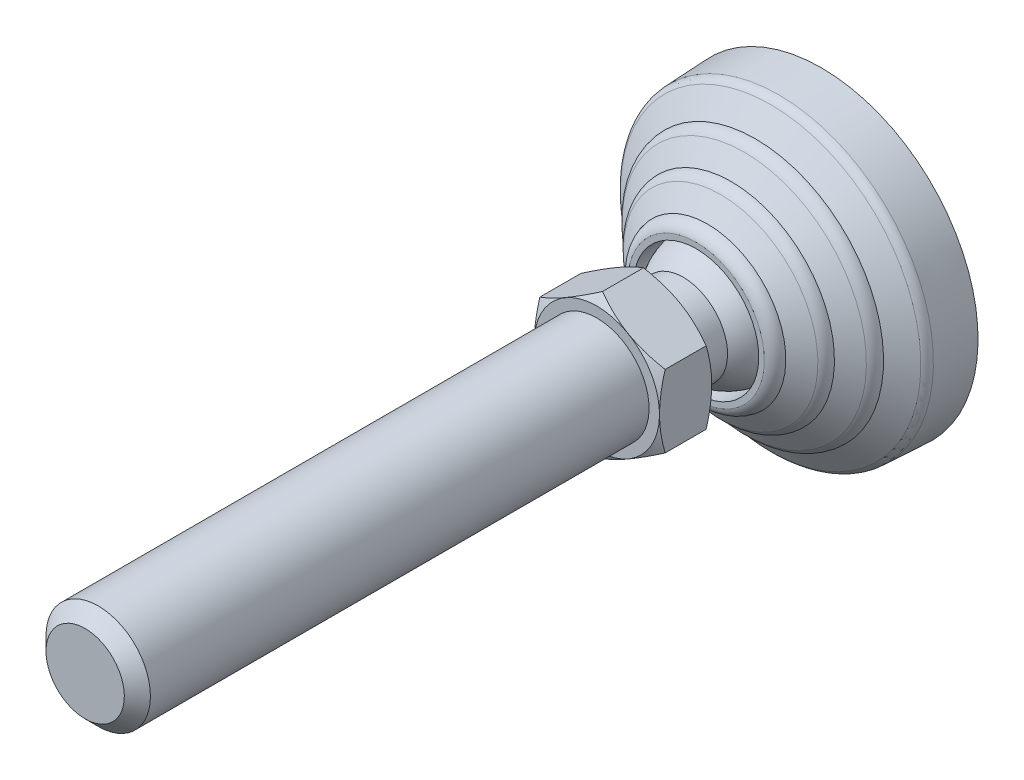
ISO-10303-21;
HEADER;
FILE_DESCRIPTION(('STEP AP214'),'2;1');
FILE_NAME('part.step','',(''),(''),'','','');
FILE_SCHEMA(('AUTOMOTIVE_DESIGN { 1 0 10303 214 1 1 1 1 }'));
ENDSEC;
DATA;
#1=APPLICATION_CONTEXT('core data for automotive mechanical design processes');
#2=APPLICATION_PROTOCOL_DEFINITION('international standard','automotive_design',2000,#1);
#3=PRODUCT_CONTEXT('',#1,'mechanical');
#4=PRODUCT('Part','Part','',(#3));
#5=PRODUCT_RELATED_PRODUCT_CATEGORY('part','',(#4));
#6=PRODUCT_DEFINITION_FORMATION('','',#4);
#7=PRODUCT_DEFINITION_CONTEXT('part definition',#1,'design');
#8=PRODUCT_DEFINITION('design','',#6,#7);
#9=PRODUCT_DEFINITION_SHAPE('','',#8);
#10=(LENGTH_UNIT() NAMED_UNIT(*) SI_UNIT(.MILLI.,.METRE.));
#11=(NAMED_UNIT(*) PLANE_ANGLE_UNIT() SI_UNIT($,.RADIAN.));
#12=(NAMED_UNIT(*) SI_UNIT($,.STERADIAN.) SOLID_ANGLE_UNIT());
#13=UNCERTAINTY_MEASURE_WITH_UNIT(LENGTH_MEASURE(1.E-05),#10,'distance_accuracy_value','');
#14=(GEOMETRIC_REPRESENTATION_CONTEXT(3) GLOBAL_UNCERTAINTY_ASSIGNED_CONTEXT((#13)) GLOBAL_UNIT_ASSIGNED_CONTEXT((#10,
#11,#12)) REPRESENTATION_CONTEXT('',''));
#15=CARTESIAN_POINT('',(0.,0.,0.));
#16=DIRECTION('',(0.,0.,1.));
#17=DIRECTION('',(1.,0.,0.));
#18=AXIS2_PLACEMENT_3D('',#15,#16,#17);
#19=CARTESIAN_POINT('',(0.,0.,110.4665));
#20=DIRECTION('',(0.,0.,-1.));
#21=DIRECTION('',(0.,1.,0.));
#22=AXIS2_PLACEMENT_3D('',#19,#20,#21);
#23=CYLINDRICAL_SURFACE('',#22,10.);
#24=CARTESIAN_POINT('',(0.,0.,138.5));
#25=DIRECTION('',(0.,0.,1.));
#26=DIRECTION('',(0.,-1.,0.));
#27=AXIS2_PLACEMENT_3D('',#24,#25,#26);
#28=CIRCLE('',#27,10.);
#29=CARTESIAN_POINT('',(0.,-10.,138.5));
#30=VERTEX_POINT('',#29);
#31=EDGE_CURVE('E9',#30,#30,#28,.F.);
#32=ORIENTED_EDGE('',*,*,#31,.T.);
#33=EDGE_LOOP('',(#32));
#34=FACE_BOUND('',#33,.T.);
#35=CARTESIAN_POINT('',(0.,0.,43.));
#36=DIRECTION('',(0.,0.,-1.));
#37=DIRECTION('',(0.,1.,0.));
#38=AXIS2_PLACEMENT_3D('',#35,#36,#37);
#39=CIRCLE('',#38,10.);
#40=CARTESIAN_POINT('',(0.,10.,43.));
#41=VERTEX_POINT('',#40);
#42=EDGE_CURVE('E124',#41,#41,#39,.F.);
#43=ORIENTED_EDGE('',*,*,#42,.T.);
#44=EDGE_LOOP('',(#43));
#45=FACE_BOUND('',#44,.T.);
#46=ADVANCED_FACE('F14',(#34,#45),#23,.T.);
#47=CARTESIAN_POINT('',(10.995,0.,43.));
#48=DIRECTION('',(0.,0.,1.));
#49=DIRECTION('',(0.,-1.,0.));
#50=AXIS2_PLACEMENT_3D('',#47,#48,#49);
#51=PLANE('',#50);
#52=CARTESIAN_POINT('',(0.,0.,43.));
#53=DIRECTION('',(0.,0.,-1.));
#54=DIRECTION('',(0.,1.,0.));
#55=AXIS2_PLACEMENT_3D('',#52,#53,#54);
#56=CIRCLE('',#55,11.99);
#57=CARTESIAN_POINT('',(0.,11.99,43.));
#58=VERTEX_POINT('',#57);
#59=EDGE_CURVE('E132',#58,#58,#56,.F.);
#60=ORIENTED_EDGE('',*,*,#59,.T.);
#61=EDGE_LOOP('',(#60));
#62=FACE_BOUND('',#61,.T.);
#63=ORIENTED_EDGE('',*,*,#42,.F.);
#64=EDGE_LOOP('',(#63));
#65=FACE_BOUND('',#64,.T.);
#66=ADVANCED_FACE('F157',(#62,#65),#51,.T.);
#67=CARTESIAN_POINT('',(0.,0.,41.9159643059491));
#68=DIRECTION('',(0.,0.,-1.));
#69=DIRECTION('',(0.,1.,0.));
#70=AXIS2_PLACEMENT_3D('',#67,#68,#69);
#71=CONICAL_SURFACE('',#70,13.8676048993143,1.0471975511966);
#72=ORIENTED_EDGE('',*,*,#59,.F.);
#73=EDGE_LOOP('',(#72));
#74=FACE_BOUND('',#73,.T.);
#75=CARTESIAN_POINT('',(-2.88482840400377E-08,-13.8564064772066,41.9224297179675));
#76=CARTESIAN_POINT('',(0.263784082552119,-13.7041106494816,42.0103407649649));
#77=CARTESIAN_POINT('',(0.528551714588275,-13.5512469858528,42.0942615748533));
#78=CARTESIAN_POINT('',(1.06021019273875,-13.2442938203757,42.2530155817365));
#79=CARTESIAN_POINT('',(1.32710170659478,-13.0902039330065,42.3278457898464));
#80=CARTESIAN_POINT('',(2.13207647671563,-12.6254515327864,42.537252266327));
#81=CARTESIAN_POINT('',(2.67333741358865,-12.3129543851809,42.6563603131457));
#82=CARTESIAN_POINT('',(3.48330954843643,-11.8453167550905,42.796023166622));
#83=CARTESIAN_POINT('',(3.74960108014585,-11.6915732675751,42.8358073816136));
#84=CARTESIAN_POINT('',(4.28341699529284,-11.3833745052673,42.9025217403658));
#85=CARTESIAN_POINT('',(4.55094140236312,-11.2289192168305,42.9294516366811));
#86=CARTESIAN_POINT('',(5.08643614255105,-10.9197511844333,42.9697675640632));
#87=CARTESIAN_POINT('',(5.35440556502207,-10.7650389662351,42.9831696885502));
#88=CARTESIAN_POINT('',(5.8905925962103,-10.4554712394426,42.996144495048));
#89=CARTESIAN_POINT('',(6.15881019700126,-10.3006157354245,42.9957176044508));
#90=CARTESIAN_POINT('',(6.66023029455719,-10.0111207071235,42.9820002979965));
#91=CARTESIAN_POINT('',(6.8934685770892,-9.87646052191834,42.97038309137));
#92=CARTESIAN_POINT('',(7.35940867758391,-9.60744987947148,42.9369099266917));
#93=CARTESIAN_POINT('',(7.59211045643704,-9.47309944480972,42.9150532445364));
#94=CARTESIAN_POINT('',(8.05685109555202,-9.20478131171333,42.8614821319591));
#95=CARTESIAN_POINT('',(8.28888924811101,-9.07081402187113,42.8297595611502));
#96=CARTESIAN_POINT('',(8.75187776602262,-8.80350747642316,42.7570131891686));
#97=CARTESIAN_POINT('',(8.9828280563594,-8.6701682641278,42.7159887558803));
#98=CARTESIAN_POINT('',(9.68388987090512,-8.26541003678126,42.5779256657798));
#99=CARTESIAN_POINT('',(10.1519713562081,-7.99516306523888,42.4671213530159));
#100=CARTESIAN_POINT('',(11.081155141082,-7.45869855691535,42.2156417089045));
#101=CARTESIAN_POINT('',(11.5422693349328,-7.19247415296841,42.075025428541));
#102=CARTESIAN_POINT('',(11.9999999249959,-6.92820327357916,41.922429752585));
#103=B_SPLINE_CURVE_WITH_KNOTS('',3,(#75,#76,#77,#78,#79,#80,#81,#82,#83,#84,#85,#86,#87,#88,
#89,#90,#91,#92,#93,#94,#95,#96,#97,#98,#99,#100,#101,#102),.UNSPECIFIED.,.F.,.F.,(4,2,2,2,2,2,
2,2,2,2,2,2,2,4),(0.,0.950996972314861,1.90230578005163,3.80897261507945,4.73890631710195,
5.66885791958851,6.59770188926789,7.52651715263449,8.33503482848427,9.14360968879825,
9.95285348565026,10.7621522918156,12.4163368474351,14.0672749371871),.UNSPECIFIED.);
#104=CARTESIAN_POINT('',(-1.44241383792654E-08,-13.8564064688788,41.9224297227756));
#105=VERTEX_POINT('',#104);
#106=CARTESIAN_POINT('',(12.,-6.92820324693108,41.9224297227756));
#107=VERTEX_POINT('',#106);
#108=EDGE_CURVE('E143',#105,#107,#103,.T.);
#109=ORIENTED_EDGE('',*,*,#108,.T.);
#110=CARTESIAN_POINT('',(12.,-6.92820326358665,41.9224297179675));
#111=CARTESIAN_POINT('',(12.,-6.64374493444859,42.0045333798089));
#112=CARTESIAN_POINT('',(12.,-6.35829458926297,42.0831531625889));
#113=CARTESIAN_POINT('',(12.,-5.78524260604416,42.2325348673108));
#114=CARTESIAN_POINT('',(12.,-5.49764024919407,42.3032940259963));
#115=CARTESIAN_POINT('',(12.,-4.63053083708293,42.5026195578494));
#116=CARTESIAN_POINT('',(12.,-4.04782834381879,42.6179071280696));
#117=CARTESIAN_POINT('',(12.,-3.17548925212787,42.7575170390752));
#118=CARTESIAN_POINT('',(12.,-2.88840964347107,42.7982045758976));
#119=CARTESIAN_POINT('',(12.,-2.31290718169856,42.8685767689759));
#120=CARTESIAN_POINT('',(12.,-2.02448443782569,42.8982623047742));
#121=CARTESIAN_POINT('',(12.,-1.44696804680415,42.9459902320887));
#122=CARTESIAN_POINT('',(12.,-1.15787537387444,42.9640443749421));
#123=CARTESIAN_POINT('',(12.,-0.579188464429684,42.9881624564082));
#124=CARTESIAN_POINT('',(12.,-0.289594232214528,42.994226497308));
#125=CARTESIAN_POINT('',(12.,0.289594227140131,42.9942264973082));
#126=CARTESIAN_POINT('',(12.,0.579188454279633,42.9881624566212));
#127=CARTESIAN_POINT('',(12.,1.15787535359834,42.9640443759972));
#128=CARTESIAN_POINT('',(12.,1.44696802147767,42.9459902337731));
#129=CARTESIAN_POINT('',(12.,2.02448440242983,42.8982623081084));
#130=CARTESIAN_POINT('',(12.,2.31290714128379,42.8685767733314));
#131=CARTESIAN_POINT('',(12.,2.88840959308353,42.798204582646));
#132=CARTESIAN_POINT('',(12.,3.17548919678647,42.7575170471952));
#133=CARTESIAN_POINT('',(12.,4.04782827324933,42.6179071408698));
#134=CARTESIAN_POINT('',(12.,4.63053075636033,42.5026195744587));
#135=CARTESIAN_POINT('',(12.,5.49764015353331,42.3032940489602));
#136=CARTESIAN_POINT('',(12.,5.78524250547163,42.2325348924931));
#137=CARTESIAN_POINT('',(12.,6.35829447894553,42.0831531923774));
#138=CARTESIAN_POINT('',(12.,6.64374481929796,42.004533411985));
#139=CARTESIAN_POINT('',(12.,6.92820314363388,41.9224297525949));
#140=B_SPLINE_CURVE_WITH_KNOTS('',3,(#110,#111,#112,#113,#114,#115,#116,#117,#118,#119,#120,
#121,#122,#123,#124,#125,#126,#127,#128,#129,#130,#131,#132,#133,#134,#135,#136,#137,#138,#139),
.UNSPECIFIED.,.F.,.F.,(4,2,2,2,2,2,2,2,2,2,2,2,2,2,4),(0.,0.888148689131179,1.77660860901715,
3.55698615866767,4.42666281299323,5.2962699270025,6.16499708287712,7.03371682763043,
7.90243655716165,8.7711636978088,9.64077079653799,10.5104474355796,12.2908249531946,
13.1792848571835,14.0674335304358),.UNSPECIFIED.);
#141=CARTESIAN_POINT('',(12.0000000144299,6.92820322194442,41.9224297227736));
#142=VERTEX_POINT('',#141);
#143=EDGE_CURVE('E135',#107,#142,#140,.T.);
#144=ORIENTED_EDGE('',*,*,#143,.T.);
#145=CARTESIAN_POINT('',(12.0000000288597,6.92820321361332,41.9224297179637));
#146=CARTESIAN_POINT('',(11.7362159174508,7.08049904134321,42.0103407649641));
#147=CARTESIAN_POINT('',(11.4714482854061,7.23336270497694,42.0942615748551));
#148=CARTESIAN_POINT('',(10.9397898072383,7.54031587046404,42.2530155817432));
#149=CARTESIAN_POINT('',(10.6728982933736,7.69440575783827,42.3278457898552));
#150=CARTESIAN_POINT('',(9.86792352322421,8.15915815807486,42.5372522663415));
#151=CARTESIAN_POINT('',(9.32666258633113,8.47165530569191,42.6563603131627));
#152=CARTESIAN_POINT('',(8.51669045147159,8.93929293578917,42.7960231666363));
#153=CARTESIAN_POINT('',(8.25039891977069,9.0930364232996,42.8358073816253));
#154=CARTESIAN_POINT('',(7.71658300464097,9.40123518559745,42.9025217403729));
#155=CARTESIAN_POINT('',(7.44905859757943,9.55569047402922,42.9294516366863));
#156=CARTESIAN_POINT('',(6.91356385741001,9.86485850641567,42.9697675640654));
#157=CARTESIAN_POINT('',(6.64559443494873,10.0195707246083,42.9831696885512));
#158=CARTESIAN_POINT('',(6.10940740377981,10.3291384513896,42.996144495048));
#159=CARTESIAN_POINT('',(5.84118980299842,10.4839939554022,42.9957176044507));
#160=CARTESIAN_POINT('',(5.33976970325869,10.773488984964,42.9820002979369));
#161=CARTESIAN_POINT('',(5.10653141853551,10.9081491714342,42.970383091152));
#162=CARTESIAN_POINT('',(4.64059131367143,11.1771598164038,42.9369099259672));
#163=CARTESIAN_POINT('',(4.4078895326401,11.3115102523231,42.9150532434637));
#164=CARTESIAN_POINT('',(3.94314888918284,11.5798283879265,42.8614821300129));
#165=CARTESIAN_POINT('',(3.71111073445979,11.7137956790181,42.8297595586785));
#166=CARTESIAN_POINT('',(3.24812221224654,11.9811022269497,42.7570131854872));
#167=CARTESIAN_POINT('',(3.01717191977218,12.1144414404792,42.7159887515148));
#168=CARTESIAN_POINT('',(2.31611009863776,12.5191996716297,42.5779256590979));
#169=CARTESIAN_POINT('',(1.84802860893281,12.7894466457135,42.4671213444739));
#170=CARTESIAN_POINT('',(0.918844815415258,13.3259111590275,42.2156416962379));
#171=CARTESIAN_POINT('',(0.457730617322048,13.5921355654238,42.0750254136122));
#172=CARTESIAN_POINT('',(2.30778996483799E-08,13.856406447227,41.9224297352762));
#173=B_SPLINE_CURVE_WITH_KNOTS('',3,(#145,#146,#147,#148,#149,#150,#151,#152,#153,#154,#155,
#156,#157,#158,#159,#160,#161,#162,#163,#164,#165,#166,#167,#168,#169,#170,#171,#172),
.UNSPECIFIED.,.F.,.F.,(4,2,2,2,2,2,2,2,2,2,2,2,2,4),(0.,0.95099697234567,1.9023057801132,
3.8089726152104,4.73890631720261,5.66885791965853,6.59770188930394,7.52651715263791,
8.33503483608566,9.14360970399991,9.95285350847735,10.7621523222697,12.4163368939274,
14.0672749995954),.UNSPECIFIED.);
#174=CARTESIAN_POINT('',(-1.15389591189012E-08,13.856406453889,41.92242973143));
#175=VERTEX_POINT('',#174);
#176=EDGE_CURVE('E180',#142,#175,#173,.T.);
#177=ORIENTED_EDGE('',*,*,#176,.T.);
#178=CARTESIAN_POINT('',(-2.30779115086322E-08,13.856406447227,41.9224297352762));
#179=CARTESIAN_POINT('',(-0.263784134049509,13.7041106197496,42.0103407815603));
#180=CARTESIAN_POINT('',(-0.528551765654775,13.5512469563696,42.0942615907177));
#181=CARTESIAN_POINT('',(-1.06021024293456,13.2442937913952,42.2530155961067));
#182=CARTESIAN_POINT('',(-1.32710175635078,13.0902039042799,42.3278458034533));
#183=CARTESIAN_POINT('',(-2.13207652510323,12.6254515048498,42.5372522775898));
#184=CARTESIAN_POINT('',(-2.6733374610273,12.3129543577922,42.656360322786));
#185=CARTESIAN_POINT('',(-3.48330959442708,11.8453167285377,42.7960231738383));
#186=CARTESIAN_POINT('',(-3.74960112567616,11.6915732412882,42.8358073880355));
#187=CARTESIAN_POINT('',(-4.28341703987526,11.3833744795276,42.9025217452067));
#188=CARTESIAN_POINT('',(-4.550941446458,11.2289191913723,42.9294516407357));
#189=CARTESIAN_POINT('',(-5.08643618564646,10.9197511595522,42.9697675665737));
#190=CARTESIAN_POINT('',(-5.35440560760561,10.7650389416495,42.9831696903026));
#191=CARTESIAN_POINT('',(-5.89059263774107,10.4554712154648,42.9961444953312));
#192=CARTESIAN_POINT('',(-6.15881023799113,10.300615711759,42.9957176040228));
#193=CARTESIAN_POINT('',(-6.66023033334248,10.0111206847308,42.9820002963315));
#194=CARTESIAN_POINT('',(-6.89346861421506,9.87646050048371,42.9703830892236));
#195=CARTESIAN_POINT('',(-7.359408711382,9.60744985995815,42.9369099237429));
#196=CARTESIAN_POINT('',(-7.59211048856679,9.4730994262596,42.9150532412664));
#197=CARTESIAN_POINT('',(-8.05685112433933,9.20478129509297,42.8614821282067));
#198=CARTESIAN_POINT('',(-8.28888927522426,9.07081400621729,42.8297595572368));
#199=CARTESIAN_POINT('',(-8.75187778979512,8.8035074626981,42.7570131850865));
#200=CARTESIAN_POINT('',(-8.98282807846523,8.67016825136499,42.7159887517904));
#201=CARTESIAN_POINT('',(-9.68388988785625,8.26541002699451,42.5779256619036));
#202=CARTESIAN_POINT('',(-10.1519713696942,7.9951630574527,42.4671213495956));
#203=CARTESIAN_POINT('',(-11.0811551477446,7.45869855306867,42.2156417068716));
#204=CARTESIAN_POINT('',(-11.5422693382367,7.19247415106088,42.0750254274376));
#205=CARTESIAN_POINT('',(-11.9999999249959,6.92820327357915,41.922429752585));
#206=B_SPLINE_CURVE_WITH_KNOTS('',3,(#178,#179,#180,#181,#182,#183,#184,#185,#186,#187,#188,
#189,#190,#191,#192,#193,#194,#195,#196,#197,#198,#199,#200,#201,#202,#203,#204,#205),
.UNSPECIFIED.,.F.,.F.,(4,2,2,2,2,2,2,2,2,2,2,2,2,4),(0.,0.9509969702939,1.90230577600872,
3.80897260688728,4.73890630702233,5.6688579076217,6.59770187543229,7.52651713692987,
8.33503480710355,9.14360966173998,9.95285345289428,10.7621522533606,12.4163367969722,
14.0672748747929),.UNSPECIFIED.);
#207=CARTESIAN_POINT('',(-12.,6.92820324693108,41.9224297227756));
#208=VERTEX_POINT('',#207);
#209=EDGE_CURVE('E172',#175,#208,#206,.T.);
#210=ORIENTED_EDGE('',*,*,#209,.T.);
#211=CARTESIAN_POINT('',(-12.,6.92820326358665,41.9224297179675));
#212=CARTESIAN_POINT('',(-12.,6.64374493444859,42.0045333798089));
#213=CARTESIAN_POINT('',(-12.,6.35829458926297,42.0831531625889));
#214=CARTESIAN_POINT('',(-12.,5.78524260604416,42.2325348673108));
#215=CARTESIAN_POINT('',(-12.,5.49764024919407,42.3032940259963));
#216=CARTESIAN_POINT('',(-12.,4.63053083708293,42.5026195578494));
#217=CARTESIAN_POINT('',(-12.,4.04782834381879,42.6179071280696));
#218=CARTESIAN_POINT('',(-12.,3.17548925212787,42.7575170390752));
#219=CARTESIAN_POINT('',(-12.,2.88840964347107,42.7982045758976));
#220=CARTESIAN_POINT('',(-12.,2.31290718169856,42.8685767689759));
#221=CARTESIAN_POINT('',(-12.,2.02448443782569,42.8982623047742));
#222=CARTESIAN_POINT('',(-12.,1.44696804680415,42.9459902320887));
#223=CARTESIAN_POINT('',(-12.,1.15787537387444,42.9640443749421));
#224=CARTESIAN_POINT('',(-12.,0.579188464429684,42.9881624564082));
#225=CARTESIAN_POINT('',(-12.,0.289594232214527,42.994226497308));
#226=CARTESIAN_POINT('',(-12.,-0.289594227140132,42.9942264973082));
#227=CARTESIAN_POINT('',(-12.,-0.579188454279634,42.9881624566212));
#228=CARTESIAN_POINT('',(-12.,-1.15787535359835,42.9640443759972));
#229=CARTESIAN_POINT('',(-12.,-1.44696802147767,42.9459902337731));
#230=CARTESIAN_POINT('',(-12.,-2.02448440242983,42.8982623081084));
#231=CARTESIAN_POINT('',(-12.,-2.31290714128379,42.8685767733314));
#232=CARTESIAN_POINT('',(-12.,-2.88840959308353,42.798204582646));
#233=CARTESIAN_POINT('',(-12.,-3.17548919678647,42.7575170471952));
#234=CARTESIAN_POINT('',(-12.,-4.04782827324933,42.6179071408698));
#235=CARTESIAN_POINT('',(-12.,-4.63053075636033,42.5026195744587));
#236=CARTESIAN_POINT('',(-12.,-5.49764015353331,42.3032940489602));
#237=CARTESIAN_POINT('',(-12.,-5.78524250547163,42.2325348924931));
#238=CARTESIAN_POINT('',(-12.,-6.35829447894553,42.0831531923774));
#239=CARTESIAN_POINT('',(-12.,-6.64374481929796,42.004533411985));
#240=CARTESIAN_POINT('',(-12.,-6.92820314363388,41.9224297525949));
#241=B_SPLINE_CURVE_WITH_KNOTS('',3,(#211,#212,#213,#214,#215,#216,#217,#218,#219,#220,#221,
#222,#223,#224,#225,#226,#227,#228,#229,#230,#231,#232,#233,#234,#235,#236,#237,#238,#239,#240),
.UNSPECIFIED.,.F.,.F.,(4,2,2,2,2,2,2,2,2,2,2,2,2,2,4),(0.,0.888148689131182,1.77660860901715,
3.55698615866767,4.42666281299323,5.2962699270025,6.16499708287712,7.03371682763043,
7.90243655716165,8.7711636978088,9.64077079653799,10.5104474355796,12.2908249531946,
13.1792848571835,14.0674335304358),.UNSPECIFIED.);
#242=CARTESIAN_POINT('',(-12.0000000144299,-6.92820322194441,41.9224297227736));
#243=VERTEX_POINT('',#242);
#244=EDGE_CURVE('E342',#208,#243,#241,.T.);
#245=ORIENTED_EDGE('',*,*,#244,.T.);
#246=CARTESIAN_POINT('',(-12.0000000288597,-6.92820321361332,41.9224297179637));
#247=CARTESIAN_POINT('',(-11.7362159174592,-7.08049904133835,42.0103407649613));
#248=CARTESIAN_POINT('',(-11.471448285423,-7.23336270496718,42.0942615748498));
#249=CARTESIAN_POINT('',(-10.9397898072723,-7.54031587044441,42.2530155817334));
#250=CARTESIAN_POINT('',(-10.6728982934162,-7.69440575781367,42.3278457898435));
#251=CARTESIAN_POINT('',(-9.86792352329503,-8.15915815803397,42.5372522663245));
#252=CARTESIAN_POINT('',(-9.3266625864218,-8.47165530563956,42.6563603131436));
#253=CARTESIAN_POINT('',(-8.5166904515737,-8.93929293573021,42.7960231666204));
#254=CARTESIAN_POINT('',(-8.25039891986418,-9.09303642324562,42.8358073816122));
#255=CARTESIAN_POINT('',(-7.71658300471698,-9.40123518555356,42.9025217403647));
#256=CARTESIAN_POINT('',(-7.44905859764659,-9.55569047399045,42.9294516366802));
#257=CARTESIAN_POINT('',(-6.91356385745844,-9.8648585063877,42.9697675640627));
#258=CARTESIAN_POINT('',(-6.64559443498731,-10.019570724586,42.9831696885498));
#259=CARTESIAN_POINT('',(-6.10940740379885,-10.3291384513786,42.996144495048));
#260=CARTESIAN_POINT('',(-5.84118980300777,-10.4839939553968,42.9957176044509));
#261=CARTESIAN_POINT('',(-5.33976970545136,-10.7734889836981,42.9820002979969));
#262=CARTESIAN_POINT('',(-5.10653142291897,-10.9081491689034,42.9703830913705));
#263=CARTESIAN_POINT('',(-4.64059132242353,-11.1771598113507,42.9369099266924));
#264=CARTESIAN_POINT('',(-4.40788954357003,-11.3115102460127,42.9150532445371));
#265=CARTESIAN_POINT('',(-3.94314890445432,-11.5798283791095,42.8614821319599));
#266=CARTESIAN_POINT('',(-3.71111075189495,-11.7137956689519,42.829759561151));
#267=CARTESIAN_POINT('',(-3.24812223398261,-11.9811022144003,42.7570131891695));
#268=CARTESIAN_POINT('',(-3.01717194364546,-12.1144414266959,42.7159887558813));
#269=CARTESIAN_POINT('',(-2.3161101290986,-12.5191996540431,42.5779256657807));
#270=CARTESIAN_POINT('',(-1.84802864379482,-12.7894466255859,42.4671213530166));
#271=CARTESIAN_POINT('',(-0.918844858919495,-13.3259111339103,42.215641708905));
#272=CARTESIAN_POINT('',(-0.457730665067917,-13.5921355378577,42.0750254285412));
#273=CARTESIAN_POINT('',(-7.50040961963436E-08,-13.8564064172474,41.922429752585));
#274=B_SPLINE_CURVE_WITH_KNOTS('',3,(#246,#247,#248,#249,#250,#251,#252,#253,#254,#255,#256,
#257,#258,#259,#260,#261,#262,#263,#264,#265,#266,#267,#268,#269,#270,#271,#272,#273),
.UNSPECIFIED.,.F.,.F.,(4,2,2,2,2,2,2,2,2,2,2,2,2,4),(0.,0.950996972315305,1.90230578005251,
3.80897261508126,4.73890631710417,5.66885791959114,6.59770188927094,7.52651715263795,
8.33503482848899,9.14360968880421,9.95285348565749,10.7621522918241,12.4163368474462,
14.0672749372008),.UNSPECIFIED.);
#275=EDGE_CURVE('E162',#243,#105,#274,.T.);
#276=ORIENTED_EDGE('',*,*,#275,.T.);
#277=EDGE_LOOP('',(#109,#144,#177,#210,#245,#276));
#278=FACE_BOUND('',#277,.T.);
#279=ADVANCED_FACE('F152',(#74,#278),#71,.T.);
#280=CARTESIAN_POINT('',(0.,-13.856406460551,43.1));
#281=DIRECTION('',(0.5,0.866025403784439,0.));
#282=DIRECTION('',(-0.866025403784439,0.5,0.));
#283=AXIS2_PLACEMENT_3D('',#280,#281,#282);
#284=PLANE('',#283);
#285=DIRECTION('',(0.,0.,1.));
#286=VECTOR('',#285,1.);
#287=CARTESIAN_POINT('',(0.,-13.856406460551,43.1));
#288=LINE('',#287,#286);
#289=CARTESIAN_POINT('',(0.,-13.856406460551,34.0775702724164));
#290=VERTEX_POINT('',#289);
#291=EDGE_CURVE('E368',#290,#105,#288,.T.);
#292=ORIENTED_EDGE('',*,*,#291,.T.);
#293=ORIENTED_EDGE('',*,*,#275,.F.);
#294=DIRECTION('',(0.,0.,1.));
#295=VECTOR('',#294,1.);
#296=CARTESIAN_POINT('',(-12.,-6.9282032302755,43.1));
#297=LINE('',#296,#295);
#298=CARTESIAN_POINT('',(-12.,-6.9282032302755,34.0775702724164));
#299=VERTEX_POINT('',#298);
#300=EDGE_CURVE('E360',#299,#243,#297,.T.);
#301=ORIENTED_EDGE('',*,*,#300,.F.);
#302=CARTESIAN_POINT('',(0.,-13.856406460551,34.0775702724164));
#303=CARTESIAN_POINT('',(-0.263784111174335,-13.7041106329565,33.9896592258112));
#304=CARTESIAN_POINT('',(-0.528551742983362,-13.5512469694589,33.9057384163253));
#305=CARTESIAN_POINT('',(-1.0602102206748,-13.2442938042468,33.7469844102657));
#306=CARTESIAN_POINT('',(-1.32710173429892,-13.0902039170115,33.6721542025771));
#307=CARTESIAN_POINT('',(-2.13207650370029,-12.6254515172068,33.4627477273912));
#308=CARTESIAN_POINT('',(-2.67333744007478,-12.3129543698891,33.3436396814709));
#309=CARTESIAN_POINT('',(-3.48330957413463,-11.8453167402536,33.2039768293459));
#310=CARTESIAN_POINT('',(-3.74960110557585,-11.6915732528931,33.1641926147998));
#311=CARTESIAN_POINT('',(-4.28341702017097,-11.3833744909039,33.097478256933));
#312=CARTESIAN_POINT('',(-4.55094142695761,-11.2289192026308,33.0705483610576));
#313=CARTESIAN_POINT('',(-5.08643616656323,-10.9197511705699,33.0302324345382));
#314=CARTESIAN_POINT('',(-5.35440558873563,-10.765038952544,33.0168303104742));
#315=CARTESIAN_POINT('',(-5.89059261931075,-10.4554712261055,33.0038555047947));
#316=CARTESIAN_POINT('',(-6.15881021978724,-10.300615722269,33.0042823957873));
#317=CARTESIAN_POINT('',(-6.66023031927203,-10.0111206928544,33.0179997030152));
#318=CARTESIAN_POINT('',(-6.8934686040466,-9.87646050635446,33.029616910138));
#319=CARTESIAN_POINT('',(-7.35940870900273,-9.6074498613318,33.063090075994));
#320=CARTESIAN_POINT('',(-7.59211049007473,-9.47309942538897,33.0849467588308));
#321=CARTESIAN_POINT('',(-8.05685113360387,-9.20478128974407,33.1385178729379));
#322=CARTESIAN_POINT('',(-8.28888928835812,-9.07081399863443,33.1702404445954));
#323=CARTESIAN_POINT('',(-8.75187781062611,-8.8035074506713,33.2429868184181));
#324=CARTESIAN_POINT('',(-8.98282810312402,-8.67016823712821,33.2840112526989));
#325=CARTESIAN_POINT('',(-9.6838899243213,-8.2654100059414,33.4220743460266));
#326=CARTESIAN_POINT('',(-10.1519714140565,-7.99516303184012,33.5328786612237));
#327=CARTESIAN_POINT('',(-11.0811552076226,-7.45869851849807,33.7843583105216));
#328=CARTESIAN_POINT('',(-11.5422694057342,-7.19247411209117,33.924974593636));
#329=CARTESIAN_POINT('',(-12.,-6.9282032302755,34.0775702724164));
#330=B_SPLINE_CURVE_WITH_KNOTS('',3,(#302,#303,#304,#305,#306,#307,#308,#309,#310,#311,#312,
#313,#314,#315,#316,#317,#318,#319,#320,#321,#322,#323,#324,#325,#326,#327,#328,#329),
.UNSPECIFIED.,.F.,.F.,(4,2,2,2,2,2,2,2,2,2,2,2,2,4),(0.,0.950996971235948,1.90230577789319,
3.80897261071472,4.73890631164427,5.66885791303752,6.59770188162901,7.52651714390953,
8.33503482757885,9.14360969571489,9.9528535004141,10.7621523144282,12.4163368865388,
14.0672749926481),.UNSPECIFIED.);
#331=EDGE_CURVE('E362',#290,#299,#330,.T.);
#332=ORIENTED_EDGE('',*,*,#331,.F.);
#333=EDGE_LOOP('',(#292,#293,#301,#332));
#334=FACE_BOUND('',#333,.T.);
#335=ADVANCED_FACE('F156',(#334),#284,.F.);
#336=CARTESIAN_POINT('',(12.,-6.92820323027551,43.1));
#337=DIRECTION('',(-0.5,0.866025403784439,0.));
#338=DIRECTION('',(-0.866025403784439,-0.5,0.));
#339=AXIS2_PLACEMENT_3D('',#336,#337,#338);
#340=PLANE('',#339);
#341=DIRECTION('',(0.,0.,1.));
#342=VECTOR('',#341,1.);
#343=CARTESIAN_POINT('',(12.,-6.92820323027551,43.1));
#344=LINE('',#343,#342);
#345=CARTESIAN_POINT('',(12.,-6.92820323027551,34.0775702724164));
#346=VERTEX_POINT('',#345);
#347=EDGE_CURVE('E31',#346,#107,#344,.T.);
#348=ORIENTED_EDGE('',*,*,#347,.T.);
#349=ORIENTED_EDGE('',*,*,#108,.F.);
#350=ORIENTED_EDGE('',*,*,#291,.F.);
#351=CARTESIAN_POINT('',(12.,-6.92820323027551,34.0775702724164));
#352=CARTESIAN_POINT('',(11.7362158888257,-7.08049905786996,33.9896592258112));
#353=CARTESIAN_POINT('',(11.4714482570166,-7.2333627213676,33.9057384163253));
#354=CARTESIAN_POINT('',(10.9397897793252,-7.5403158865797,33.7469844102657));
#355=CARTESIAN_POINT('',(10.6728982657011,-7.69440577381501,33.6721542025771));
#356=CARTESIAN_POINT('',(9.86792349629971,-8.15915817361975,33.4627477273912));
#357=CARTESIAN_POINT('',(9.32666255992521,-8.4716553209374,33.3436396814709));
#358=CARTESIAN_POINT('',(8.51669042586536,-8.93929295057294,33.2039768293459));
#359=CARTESIAN_POINT('',(8.25039889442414,-9.09303643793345,33.1641926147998));
#360=CARTESIAN_POINT('',(7.71658297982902,-9.40123519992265,33.097478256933));
#361=CARTESIAN_POINT('',(7.44905857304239,-9.55569048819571,33.0705483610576));
#362=CARTESIAN_POINT('',(6.91356383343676,-9.86485852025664,33.0302324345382));
#363=CARTESIAN_POINT('',(6.64559441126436,-10.0195707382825,33.0168303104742));
#364=CARTESIAN_POINT('',(6.10940738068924,-10.329138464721,33.0038555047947));
#365=CARTESIAN_POINT('',(5.84118978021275,-10.4839939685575,33.0042823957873));
#366=CARTESIAN_POINT('',(5.33976968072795,-10.7734889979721,33.0179997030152));
#367=CARTESIAN_POINT('',(5.10653139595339,-10.9081491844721,33.029616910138));
#368=CARTESIAN_POINT('',(4.64059129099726,-11.1771598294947,33.063090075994));
#369=CARTESIAN_POINT('',(4.40788950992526,-11.3115102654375,33.0849467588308));
#370=CARTESIAN_POINT('',(3.94314886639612,-11.5798284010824,33.1385178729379));
#371=CARTESIAN_POINT('',(3.71111071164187,-11.7137956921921,33.1702404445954));
#372=CARTESIAN_POINT('',(3.24812218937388,-11.9811022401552,33.2429868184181));
#373=CARTESIAN_POINT('',(3.01717189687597,-12.1144414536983,33.2840112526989));
#374=CARTESIAN_POINT('',(2.3161100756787,-12.5191996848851,33.4220743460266));
#375=CARTESIAN_POINT('',(1.84802858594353,-12.7894466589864,33.5328786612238));
#376=CARTESIAN_POINT('',(0.918844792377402,-13.3259111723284,33.7843583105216));
#377=CARTESIAN_POINT('',(0.457730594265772,-13.5921355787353,33.924974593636));
#378=CARTESIAN_POINT('',(0.,-13.856406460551,34.0775702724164));
#379=B_SPLINE_CURVE_WITH_KNOTS('',3,(#351,#352,#353,#354,#355,#356,#357,#358,#359,#360,#361,
#362,#363,#364,#365,#366,#367,#368,#369,#370,#371,#372,#373,#374,#375,#376,#377,#378),
.UNSPECIFIED.,.F.,.F.,(4,2,2,2,2,2,2,2,2,2,2,2,2,4),(0.,0.95099697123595,1.90230577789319,
3.80897261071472,4.73890631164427,5.66885791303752,6.59770188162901,7.52651714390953,
8.33503482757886,9.14360969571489,9.9528535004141,10.7621523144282,12.4163368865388,
14.0672749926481),.UNSPECIFIED.);
#380=EDGE_CURVE('E369',#346,#290,#379,.T.);
#381=ORIENTED_EDGE('',*,*,#380,.F.);
#382=EDGE_LOOP('',(#348,#349,#350,#381));
#383=FACE_BOUND('',#382,.T.);
#384=ADVANCED_FACE('F375',(#383),#340,.F.);
#385=CARTESIAN_POINT('',(-12.,6.92820323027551,43.1));
#386=DIRECTION('',(0.5,-0.866025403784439,0.));
#387=DIRECTION('',(0.866025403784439,0.5,0.));
#388=AXIS2_PLACEMENT_3D('',#385,#386,#387);
#389=PLANE('',#388);
#390=DIRECTION('',(0.,0.,1.));
#391=VECTOR('',#390,1.);
#392=CARTESIAN_POINT('',(-12.,6.92820323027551,43.1));
#393=LINE('',#392,#391);
#394=CARTESIAN_POINT('',(-12.,6.92820323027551,34.0775702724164));
#395=VERTEX_POINT('',#394);
#396=EDGE_CURVE('E361',#395,#208,#393,.T.);
#397=ORIENTED_EDGE('',*,*,#396,.T.);
#398=ORIENTED_EDGE('',*,*,#209,.F.);
#399=DIRECTION('',(0.,0.,1.));
#400=VECTOR('',#399,1.);
#401=CARTESIAN_POINT('',(0.,13.856406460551,43.1));
#402=LINE('',#401,#400);
#403=CARTESIAN_POINT('',(0.,13.856406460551,34.0775702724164));
#404=VERTEX_POINT('',#403);
#405=EDGE_CURVE('E211',#404,#175,#402,.T.);
#406=ORIENTED_EDGE('',*,*,#405,.F.);
#407=CARTESIAN_POINT('',(-12.,6.92820323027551,34.0775702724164));
#408=CARTESIAN_POINT('',(-11.7362158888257,7.08049905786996,33.9896592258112));
#409=CARTESIAN_POINT('',(-11.4714482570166,7.2333627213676,33.9057384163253));
#410=CARTESIAN_POINT('',(-10.9397897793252,7.5403158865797,33.7469844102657));
#411=CARTESIAN_POINT('',(-10.6728982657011,7.69440577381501,33.6721542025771));
#412=CARTESIAN_POINT('',(-9.86792349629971,8.15915817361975,33.4627477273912));
#413=CARTESIAN_POINT('',(-9.32666255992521,8.4716553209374,33.3436396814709));
#414=CARTESIAN_POINT('',(-8.51669042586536,8.93929295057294,33.2039768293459));
#415=CARTESIAN_POINT('',(-8.25039889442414,9.09303643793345,33.1641926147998));
#416=CARTESIAN_POINT('',(-7.71658297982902,9.40123519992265,33.097478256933));
#417=CARTESIAN_POINT('',(-7.44905857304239,9.55569048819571,33.0705483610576));
#418=CARTESIAN_POINT('',(-6.91356383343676,9.86485852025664,33.0302324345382));
#419=CARTESIAN_POINT('',(-6.64559441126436,10.0195707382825,33.0168303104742));
#420=CARTESIAN_POINT('',(-6.10940738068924,10.329138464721,33.0038555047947));
#421=CARTESIAN_POINT('',(-5.84118978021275,10.4839939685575,33.0042823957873));
#422=CARTESIAN_POINT('',(-5.33976968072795,10.7734889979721,33.0179997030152));
#423=CARTESIAN_POINT('',(-5.10653139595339,10.9081491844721,33.029616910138));
#424=CARTESIAN_POINT('',(-4.64059129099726,11.1771598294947,33.063090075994));
#425=CARTESIAN_POINT('',(-4.40788950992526,11.3115102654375,33.0849467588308));
#426=CARTESIAN_POINT('',(-3.94314886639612,11.5798284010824,33.1385178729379));
#427=CARTESIAN_POINT('',(-3.71111071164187,11.7137956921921,33.1702404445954));
#428=CARTESIAN_POINT('',(-3.24812218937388,11.9811022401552,33.2429868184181));
#429=CARTESIAN_POINT('',(-3.01717189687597,12.1144414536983,33.2840112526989));
#430=CARTESIAN_POINT('',(-2.3161100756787,12.5191996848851,33.4220743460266));
#431=CARTESIAN_POINT('',(-1.84802858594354,12.7894466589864,33.5328786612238));
#432=CARTESIAN_POINT('',(-0.918844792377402,13.3259111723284,33.7843583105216));
#433=CARTESIAN_POINT('',(-0.457730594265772,13.5921355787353,33.924974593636));
#434=CARTESIAN_POINT('',(0.,13.856406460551,34.0775702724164));
#435=B_SPLINE_CURVE_WITH_KNOTS('',3,(#407,#408,#409,#410,#411,#412,#413,#414,#415,#416,#417,
#418,#419,#420,#421,#422,#423,#424,#425,#426,#427,#428,#429,#430,#431,#432,#433,#434),
.UNSPECIFIED.,.F.,.F.,(4,2,2,2,2,2,2,2,2,2,2,2,2,4),(0.,0.95099697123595,1.90230577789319,
3.80897261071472,4.73890631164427,5.66885791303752,6.59770188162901,7.52651714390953,
8.33503482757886,9.14360969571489,9.9528535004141,10.7621523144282,12.4163368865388,
14.0672749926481),.UNSPECIFIED.);
#436=EDGE_CURVE('E213',#395,#404,#435,.T.);
#437=ORIENTED_EDGE('',*,*,#436,.F.);
#438=EDGE_LOOP('',(#397,#398,#406,#437));
#439=FACE_BOUND('',#438,.T.);
#440=ADVANCED_FACE('F199',(#439),#389,.F.);
#441=CARTESIAN_POINT('',(-12.,-6.92820323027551,43.1));
#442=DIRECTION('',(1.,0.,0.));
#443=DIRECTION('',(0.,1.,0.));
#444=AXIS2_PLACEMENT_3D('',#441,#442,#443);
#445=PLANE('',#444);
#446=ORIENTED_EDGE('',*,*,#300,.T.);
#447=ORIENTED_EDGE('',*,*,#244,.F.);
#448=ORIENTED_EDGE('',*,*,#396,.F.);
#449=CARTESIAN_POINT('',(-12.,-6.9282032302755,34.0775702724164));
#450=CARTESIAN_POINT('',(-12.,-6.64374490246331,33.9954666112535));
#451=CARTESIAN_POINT('',(-12.,-6.35829455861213,33.9168468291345));
#452=CARTESIAN_POINT('',(-12.,-5.78524257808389,33.7674651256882));
#453=CARTESIAN_POINT('',(-12.,-5.49764022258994,33.6967059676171));
#454=CARTESIAN_POINT('',(-12.,-4.63053081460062,33.4973804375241));
#455=CARTESIAN_POINT('',(-12.,-4.04782832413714,33.3820928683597));
#456=CARTESIAN_POINT('',(-12.,-3.17548923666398,33.2424829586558));
#457=CARTESIAN_POINT('',(-12.,-2.88840962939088,33.2017954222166));
#458=CARTESIAN_POINT('',(-12.,-2.31290717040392,33.1314232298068));
#459=CARTESIAN_POINT('',(-12.,-2.02448442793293,33.1017376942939));
#460=CARTESIAN_POINT('',(-12.,-1.44696803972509,33.0540097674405));
#461=CARTESIAN_POINT('',(-12.,-1.1578753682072,33.035955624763));
#462=CARTESIAN_POINT('',(-12.,-0.579188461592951,33.0118375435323));
#463=CARTESIAN_POINT('',(-12.,-0.289594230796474,33.0057735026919));
#464=CARTESIAN_POINT('',(-12.,0.28959423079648,33.0057735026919));
#465=CARTESIAN_POINT('',(-12.,0.579188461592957,33.0118375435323));
#466=CARTESIAN_POINT('',(-12.,1.15787536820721,33.035955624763));
#467=CARTESIAN_POINT('',(-12.,1.4469680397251,33.0540097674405));
#468=CARTESIAN_POINT('',(-12.,2.02448442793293,33.1017376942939));
#469=CARTESIAN_POINT('',(-12.,2.31290717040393,33.1314232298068));
#470=CARTESIAN_POINT('',(-12.,2.88840962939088,33.2017954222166));
#471=CARTESIAN_POINT('',(-12.,3.17548923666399,33.2424829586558));
#472=CARTESIAN_POINT('',(-12.,4.04782832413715,33.3820928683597));
#473=CARTESIAN_POINT('',(-12.,4.63053081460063,33.4973804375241));
#474=CARTESIAN_POINT('',(-12.,5.49764022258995,33.6967059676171));
#475=CARTESIAN_POINT('',(-12.,5.7852425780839,33.7674651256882));
#476=CARTESIAN_POINT('',(-12.,6.35829455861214,33.9168468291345));
#477=CARTESIAN_POINT('',(-12.,6.64374490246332,33.9954666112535));
#478=CARTESIAN_POINT('',(-12.,6.92820323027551,34.0775702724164));
#479=B_SPLINE_CURVE_WITH_KNOTS('',3,(#449,#450,#451,#452,#453,#454,#455,#456,#457,#458,#459,
#460,#461,#462,#463,#464,#465,#466,#467,#468,#469,#470,#471,#472,#473,#474,#475,#476,#477,#478),
.UNSPECIFIED.,.F.,.F.,(4,2,2,2,2,2,2,2,2,2,2,2,2,2,4),(0.,0.888148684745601,1.77660860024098,
3.55698614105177,4.42666279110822,5.29626990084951,6.16499705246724,7.03371679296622,
7.90243653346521,8.77116368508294,9.64077079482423,10.5104474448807,12.2908249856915,
13.1792849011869,14.0674335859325),.UNSPECIFIED.);
#480=EDGE_CURVE('E354',#299,#395,#479,.T.);
#481=ORIENTED_EDGE('',*,*,#480,.F.);
#482=EDGE_LOOP('',(#446,#447,#448,#481));
#483=FACE_BOUND('',#482,.T.);
#484=ADVANCED_FACE('F348',(#483),#445,.F.);
#485=CARTESIAN_POINT('',(12.,6.92820323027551,43.1));
#486=DIRECTION('',(-1.,0.,0.));
#487=DIRECTION('',(0.,-1.,0.));
#488=AXIS2_PLACEMENT_3D('',#485,#486,#487);
#489=PLANE('',#488);
#490=DIRECTION('',(0.,0.,1.));
#491=VECTOR('',#490,1.);
#492=CARTESIAN_POINT('',(12.,6.92820323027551,43.1));
#493=LINE('',#492,#491);
#494=CARTESIAN_POINT('',(12.,6.9282032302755,34.0775702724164));
#495=VERTEX_POINT('',#494);
#496=EDGE_CURVE('E402',#142,#495,#493,.F.);
#497=ORIENTED_EDGE('',*,*,#496,.F.);
#498=ORIENTED_EDGE('',*,*,#143,.F.);
#499=ORIENTED_EDGE('',*,*,#347,.F.);
#500=CARTESIAN_POINT('',(12.,6.92820323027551,34.0775702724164));
#501=CARTESIAN_POINT('',(12.,6.64374490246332,33.9954666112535));
#502=CARTESIAN_POINT('',(12.,6.35829455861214,33.9168468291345));
#503=CARTESIAN_POINT('',(12.,5.7852425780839,33.7674651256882));
#504=CARTESIAN_POINT('',(12.,5.49764022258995,33.6967059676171));
#505=CARTESIAN_POINT('',(12.,4.63053081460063,33.4973804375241));
#506=CARTESIAN_POINT('',(12.,4.04782832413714,33.3820928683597));
#507=CARTESIAN_POINT('',(12.,3.17548923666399,33.2424829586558));
#508=CARTESIAN_POINT('',(12.,2.88840962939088,33.2017954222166));
#509=CARTESIAN_POINT('',(12.,2.31290717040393,33.1314232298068));
#510=CARTESIAN_POINT('',(12.,2.02448442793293,33.1017376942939));
#511=CARTESIAN_POINT('',(12.,1.4469680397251,33.0540097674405));
#512=CARTESIAN_POINT('',(12.,1.1578753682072,33.035955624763));
#513=CARTESIAN_POINT('',(12.,0.579188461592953,33.0118375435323));
#514=CARTESIAN_POINT('',(12.,0.289594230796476,33.0057735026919));
#515=CARTESIAN_POINT('',(12.,-0.289594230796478,33.0057735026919));
#516=CARTESIAN_POINT('',(12.,-0.579188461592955,33.0118375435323));
#517=CARTESIAN_POINT('',(12.,-1.15787536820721,33.035955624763));
#518=CARTESIAN_POINT('',(12.,-1.4469680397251,33.0540097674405));
#519=CARTESIAN_POINT('',(12.,-2.02448442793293,33.1017376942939));
#520=CARTESIAN_POINT('',(12.,-2.31290717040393,33.1314232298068));
#521=CARTESIAN_POINT('',(12.,-2.88840962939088,33.2017954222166));
#522=CARTESIAN_POINT('',(12.,-3.17548923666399,33.2424829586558));
#523=CARTESIAN_POINT('',(12.,-4.04782832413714,33.3820928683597));
#524=CARTESIAN_POINT('',(12.,-4.63053081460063,33.4973804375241));
#525=CARTESIAN_POINT('',(12.,-5.49764022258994,33.6967059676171));
#526=CARTESIAN_POINT('',(12.,-5.78524257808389,33.7674651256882));
#527=CARTESIAN_POINT('',(12.,-6.35829455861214,33.9168468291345));
#528=CARTESIAN_POINT('',(12.,-6.64374490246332,33.9954666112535));
#529=CARTESIAN_POINT('',(12.,-6.92820323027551,34.0775702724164));
#530=B_SPLINE_CURVE_WITH_KNOTS('',3,(#500,#501,#502,#503,#504,#505,#506,#507,#508,#509,#510,
#511,#512,#513,#514,#515,#516,#517,#518,#519,#520,#521,#522,#523,#524,#525,#526,#527,#528,#529),
.UNSPECIFIED.,.F.,.F.,(4,2,2,2,2,2,2,2,2,2,2,2,2,2,4),(0.,0.888148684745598,1.77660860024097,
3.55698614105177,4.42666279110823,5.29626990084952,6.16499705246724,7.03371679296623,
7.90243653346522,8.77116368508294,9.64077079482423,10.5104474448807,12.2908249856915,
13.1792849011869,14.0674335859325),.UNSPECIFIED.);
#531=EDGE_CURVE('E188',#495,#346,#530,.T.);
#532=ORIENTED_EDGE('',*,*,#531,.F.);
#533=EDGE_LOOP('',(#497,#498,#499,#532));
#534=FACE_BOUND('',#533,.T.);
#535=ADVANCED_FACE('F150',(#534),#489,.F.);
#536=CARTESIAN_POINT('',(0.,13.856406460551,43.1));
#537=DIRECTION('',(-0.5,-0.866025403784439,0.));
#538=DIRECTION('',(0.866025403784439,-0.5,0.));
#539=AXIS2_PLACEMENT_3D('',#536,#537,#538);
#540=PLANE('',#539);
#541=ORIENTED_EDGE('',*,*,#405,.T.);
#542=ORIENTED_EDGE('',*,*,#176,.F.);
#543=ORIENTED_EDGE('',*,*,#496,.T.);
#544=CARTESIAN_POINT('',(0.,13.856406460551,34.0775702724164));
#545=CARTESIAN_POINT('',(0.263784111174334,13.7041106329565,33.9896592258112));
#546=CARTESIAN_POINT('',(0.528551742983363,13.5512469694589,33.9057384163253));
#547=CARTESIAN_POINT('',(1.0602102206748,13.2442938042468,33.7469844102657));
#548=CARTESIAN_POINT('',(1.32710173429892,13.0902039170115,33.6721542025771));
#549=CARTESIAN_POINT('',(2.13207650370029,12.6254515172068,33.4627477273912));
#550=CARTESIAN_POINT('',(2.67333744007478,12.3129543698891,33.3436396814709));
#551=CARTESIAN_POINT('',(3.48330957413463,11.8453167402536,33.2039768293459));
#552=CARTESIAN_POINT('',(3.74960110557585,11.6915732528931,33.1641926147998));
#553=CARTESIAN_POINT('',(4.28341702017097,11.3833744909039,33.097478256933));
#554=CARTESIAN_POINT('',(4.55094142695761,11.2289192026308,33.0705483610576));
#555=CARTESIAN_POINT('',(5.08643616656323,10.9197511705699,33.0302324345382));
#556=CARTESIAN_POINT('',(5.35440558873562,10.765038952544,33.0168303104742));
#557=CARTESIAN_POINT('',(5.89059261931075,10.4554712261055,33.0038555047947));
#558=CARTESIAN_POINT('',(6.15881021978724,10.300615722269,33.0042823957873));
#559=CARTESIAN_POINT('',(6.66023031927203,10.0111206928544,33.0179997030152));
#560=CARTESIAN_POINT('',(6.8934686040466,9.87646050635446,33.029616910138));
#561=CARTESIAN_POINT('',(7.35940870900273,9.6074498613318,33.063090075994));
#562=CARTESIAN_POINT('',(7.59211049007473,9.47309942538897,33.0849467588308));
#563=CARTESIAN_POINT('',(8.05685113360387,9.20478128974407,33.1385178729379));
#564=CARTESIAN_POINT('',(8.28888928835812,9.07081399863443,33.1702404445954));
#565=CARTESIAN_POINT('',(8.75187781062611,8.8035074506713,33.2429868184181));
#566=CARTESIAN_POINT('',(8.98282810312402,8.67016823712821,33.2840112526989));
#567=CARTESIAN_POINT('',(9.6838899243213,8.2654100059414,33.4220743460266));
#568=CARTESIAN_POINT('',(10.1519714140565,7.99516303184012,33.5328786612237));
#569=CARTESIAN_POINT('',(11.0811552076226,7.45869851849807,33.7843583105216));
#570=CARTESIAN_POINT('',(11.5422694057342,7.19247411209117,33.924974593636));
#571=CARTESIAN_POINT('',(12.,6.9282032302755,34.0775702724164));
#572=B_SPLINE_CURVE_WITH_KNOTS('',3,(#544,#545,#546,#547,#548,#549,#550,#551,#552,#553,#554,
#555,#556,#557,#558,#559,#560,#561,#562,#563,#564,#565,#566,#567,#568,#569,#570,#571),
.UNSPECIFIED.,.F.,.F.,(4,2,2,2,2,2,2,2,2,2,2,2,2,4),(0.,0.950996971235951,1.90230577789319,
3.80897261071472,4.73890631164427,5.66885791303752,6.59770188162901,7.52651714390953,
8.33503482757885,9.14360969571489,9.9528535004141,10.7621523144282,12.4163368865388,
14.0672749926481),.UNSPECIFIED.);
#573=EDGE_CURVE('E68',#404,#495,#572,.T.);
#574=ORIENTED_EDGE('',*,*,#573,.F.);
#575=EDGE_LOOP('',(#541,#542,#543,#574));
#576=FACE_BOUND('',#575,.T.);
#577=ADVANCED_FACE('F195',(#576),#540,.F.);
#578=CARTESIAN_POINT('',(0.,0.,34.0840356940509));
#579=DIRECTION('',(0.,0.,1.));
#580=DIRECTION('',(0.,-1.,0.));
#581=AXIS2_PLACEMENT_3D('',#578,#579,#580);
#582=CONICAL_SURFACE('',#581,13.8676048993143,1.0471975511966);
#583=CARTESIAN_POINT('',(0.,0.,33.));
#584=DIRECTION('',(0.,0.,1.));
#585=DIRECTION('',(0.,-1.,0.));
#586=AXIS2_PLACEMENT_3D('',#583,#584,#585);
#587=CIRCLE('',#586,11.99);
#588=CARTESIAN_POINT('',(0.,-11.99,33.));
#589=VERTEX_POINT('',#588);
#590=EDGE_CURVE('E212',#589,#589,#587,.T.);
#591=ORIENTED_EDGE('',*,*,#590,.T.);
#592=EDGE_LOOP('',(#591));
#593=FACE_BOUND('',#592,.T.);
#594=ORIENTED_EDGE('',*,*,#573,.T.);
#595=ORIENTED_EDGE('',*,*,#531,.T.);
#596=ORIENTED_EDGE('',*,*,#380,.T.);
#597=ORIENTED_EDGE('',*,*,#331,.T.);
#598=ORIENTED_EDGE('',*,*,#480,.T.);
#599=ORIENTED_EDGE('',*,*,#436,.T.);
#600=EDGE_LOOP('',(#594,#595,#596,#597,#598,#599));
#601=FACE_BOUND('',#600,.T.);
#602=ADVANCED_FACE('F198',(#593,#601),#582,.T.);
#603=CARTESIAN_POINT('',(10.245,0.,33.));
#604=DIRECTION('',(0.,0.,-1.));
#605=DIRECTION('',(0.,1.,0.));
#606=AXIS2_PLACEMENT_3D('',#603,#604,#605);
#607=PLANE('',#606);
#608=CARTESIAN_POINT('',(0.,0.,33.));
#609=DIRECTION('',(0.,0.,-1.));
#610=DIRECTION('',(0.,1.,0.));
#611=AXIS2_PLACEMENT_3D('',#608,#609,#610);
#612=CIRCLE('',#611,8.5);
#613=CARTESIAN_POINT('',(0.,8.5,33.));
#614=VERTEX_POINT('',#613);
#615=EDGE_CURVE('E221',#614,#614,#612,.F.);
#616=ORIENTED_EDGE('',*,*,#615,.T.);
#617=EDGE_LOOP('',(#616));
#618=FACE_BOUND('',#617,.T.);
#619=ORIENTED_EDGE('',*,*,#590,.F.);
#620=EDGE_LOOP('',(#619));
#621=FACE_BOUND('',#620,.T.);
#622=ADVANCED_FACE('F429',(#618,#621),#607,.T.);
#623=CARTESIAN_POINT('',(0.,0.,29.7352685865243));
#624=DIRECTION('',(0.,0.,-1.));
#625=DIRECTION('',(0.,1.,0.));
#626=AXIS2_PLACEMENT_3D('',#623,#624,#625);
#627=CYLINDRICAL_SURFACE('',#626,8.5);
#628=ORIENTED_EDGE('',*,*,#615,.F.);
#629=EDGE_LOOP('',(#628));
#630=FACE_BOUND('',#629,.T.);
#631=CARTESIAN_POINT('',(0.,0.,26.4705371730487));
#632=DIRECTION('',(0.,0.,-1.));
#633=DIRECTION('',(0.,1.,0.));
#634=AXIS2_PLACEMENT_3D('',#631,#632,#633);
#635=CIRCLE('',#634,8.5);
#636=CARTESIAN_POINT('',(0.,8.5,26.4705371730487));
#637=VERTEX_POINT('',#636);
#638=EDGE_CURVE('E97',#637,#637,#635,.F.);
#639=ORIENTED_EDGE('',*,*,#638,.T.);
#640=EDGE_LOOP('',(#639));
#641=FACE_BOUND('',#640,.T.);
#642=ADVANCED_FACE('F117',(#630,#641),#627,.T.);
#643=CARTESIAN_POINT('',(0.,0.,18.));
#644=DIRECTION('',(1.,0.,0.));
#645=DIRECTION('',(0.,0.,1.));
#646=AXIS2_PLACEMENT_3D('',#643,#644,#645);
#647=SPHERICAL_SURFACE('',#646,12.);
#648=CARTESIAN_POINT('',(0.,0.,18.));
#649=DIRECTION('',(0.,0.,1.));
#650=DIRECTION('',(1.,0.,0.));
#651=AXIS2_PLACEMENT_3D('',#648,#649,#650);
#652=CIRCLE('',#651,12.);
#653=CARTESIAN_POINT('',(0.,12.,18.));
#654=VERTEX_POINT('',#653);
#655=CARTESIAN_POINT('',(-12.,0.,18.));
#656=VERTEX_POINT('',#655);
#657=EDGE_CURVE('E77',#654,#656,#652,.T.);
#658=ORIENTED_EDGE('',*,*,#657,.T.);
#659=CARTESIAN_POINT('',(-12.,0.,18.));
#660=CARTESIAN_POINT('',(-12.0000041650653,-0.196349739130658,18.));
#661=CARTESIAN_POINT('',(-11.9951810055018,-0.392699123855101,18.));
#662=CARTESIAN_POINT('',(-11.9759099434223,-0.784925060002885,18.));
#663=CARTESIAN_POINT('',(-11.9614620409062,-0.980801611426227,18.));
#664=CARTESIAN_POINT('',(-11.9229713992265,-1.37160975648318,18.));
#665=CARTESIAN_POINT('',(-11.8989286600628,-1.5665413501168,18.));
#666=CARTESIAN_POINT('',(-11.841307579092,-1.95499003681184,18.));
#667=CARTESIAN_POINT('',(-11.8077292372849,-2.14850712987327,18.));
#668=CARTESIAN_POINT('',(-11.7311174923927,-2.53366059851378,18.));
#669=CARTESIAN_POINT('',(-11.6880840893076,-2.72529697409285,18.));
#670=CARTESIAN_POINT('',(-11.5926659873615,-3.10622734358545,18.));
#671=CARTESIAN_POINT('',(-11.5402812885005,-3.29552133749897,18.));
#672=CARTESIAN_POINT('',(-11.4262867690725,-3.67131091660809,18.));
#673=CARTESIAN_POINT('',(-11.3646769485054,-3.85780650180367,18.));
#674=CARTESIAN_POINT('',(-11.2323806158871,-4.22754997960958,18.));
#675=CARTESIAN_POINT('',(-11.1616941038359,-4.41079787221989,18.));
#676=CARTESIAN_POINT('',(-11.011414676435,-4.77360450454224,18.));
#677=CARTESIAN_POINT('',(-10.9318217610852,-4.95316324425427,18.));
#678=CARTESIAN_POINT('',(-10.7639212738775,-5.30815899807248,18.));
#679=CARTESIAN_POINT('',(-10.6756137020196,-5.48359601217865,18.));
#680=CARTESIAN_POINT('',(-10.4904966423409,-5.82992567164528,17.9999999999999));
#681=CARTESIAN_POINT('',(-10.3936871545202,-6.00081831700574,17.9999999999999));
#682=CARTESIAN_POINT('',(-10.1917994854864,-6.33764754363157,17.9999999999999));
#683=CARTESIAN_POINT('',(-10.0867213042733,-6.50358412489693,17.9999999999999));
#684=CARTESIAN_POINT('',(-9.8685493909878,-6.83010146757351,17.9999999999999));
#685=CARTESIAN_POINT('',(-9.75545565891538,-6.99068222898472,17.9999999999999));
#686=CARTESIAN_POINT('',(-9.5215250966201,-7.30610107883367,17.9999999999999));
#687=CARTESIAN_POINT('',(-9.40068826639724,-7.4609391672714,17.9999999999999));
#688=CARTESIAN_POINT('',(-9.15156261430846,-7.76449965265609,17.9999999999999));
#689=CARTESIAN_POINT('',(-9.02327379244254,-7.91322204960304,17.9999999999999));
#690=CARTESIAN_POINT('',(-8.75955321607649,-8.20419286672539,17.9999999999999));
#691=CARTESIAN_POINT('',(-8.62412146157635,-8.3464412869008,17.9999999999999));
#692=CARTESIAN_POINT('',(-8.3464412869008,-8.62412146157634,17.9999999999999));
#693=CARTESIAN_POINT('',(-8.2041928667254,-8.75955321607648,17.9999999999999));
#694=CARTESIAN_POINT('',(-7.91322204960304,-9.02327379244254,17.9999999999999));
#695=CARTESIAN_POINT('',(-7.76449965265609,-9.15156261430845,17.9999999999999));
#696=CARTESIAN_POINT('',(-7.4609391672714,-9.40068826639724,17.9999999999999));
#697=CARTESIAN_POINT('',(-7.30610107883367,-9.5215250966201,17.9999999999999));
#698=CARTESIAN_POINT('',(-6.99068222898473,-9.75545565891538,17.9999999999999));
#699=CARTESIAN_POINT('',(-6.83010146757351,-9.8685493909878,17.9999999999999));
#700=CARTESIAN_POINT('',(-6.50358412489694,-10.0867213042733,17.9999999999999));
#701=CARTESIAN_POINT('',(-6.33764754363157,-10.1917994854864,17.9999999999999));
#702=CARTESIAN_POINT('',(-6.00081831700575,-10.3936871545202,17.9999999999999));
#703=CARTESIAN_POINT('',(-5.82992567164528,-10.4904966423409,17.9999999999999));
#704=CARTESIAN_POINT('',(-5.48359601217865,-10.6756137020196,17.9999999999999));
#705=CARTESIAN_POINT('',(-5.30815899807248,-10.7639212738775,17.9999999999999));
#706=CARTESIAN_POINT('',(-4.95316324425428,-10.9318217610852,17.9999999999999));
#707=CARTESIAN_POINT('',(-4.77360450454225,-11.011414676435,17.9999999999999));
#708=CARTESIAN_POINT('',(-4.4107978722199,-11.1616941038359,17.9999999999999));
#709=CARTESIAN_POINT('',(-4.22754997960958,-11.2323806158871,17.9999999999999));
#710=CARTESIAN_POINT('',(-3.85780650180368,-11.3646769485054,17.9999999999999));
#711=CARTESIAN_POINT('',(-3.67131091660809,-11.4262867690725,17.9999999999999));
#712=CARTESIAN_POINT('',(-3.29552133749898,-11.5402812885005,17.9999999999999));
#713=CARTESIAN_POINT('',(-3.10622734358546,-11.5926659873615,17.9999999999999));
#714=CARTESIAN_POINT('',(-2.72529697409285,-11.6880840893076,17.9999999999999));
#715=CARTESIAN_POINT('',(-2.53366059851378,-11.7311174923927,17.9999999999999));
#716=CARTESIAN_POINT('',(-2.14850712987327,-11.8077292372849,17.9999999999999));
#717=CARTESIAN_POINT('',(-1.95499003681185,-11.841307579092,17.9999999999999));
#718=CARTESIAN_POINT('',(-1.5665413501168,-11.8989286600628,17.9999999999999));
#719=CARTESIAN_POINT('',(-1.37160975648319,-11.9229713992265,17.9999999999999));
#720=CARTESIAN_POINT('',(-0.980801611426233,-11.9614620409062,17.9999999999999));
#721=CARTESIAN_POINT('',(-0.78492506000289,-11.9759099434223,17.9999999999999));
#722=CARTESIAN_POINT('',(-0.392699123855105,-11.9951810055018,17.9999999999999));
#723=CARTESIAN_POINT('',(-0.196349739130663,-12.0000041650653,17.9999999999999));
#724=CARTESIAN_POINT('',(0.,-12.,17.9999999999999));
#725=B_SPLINE_CURVE_WITH_KNOTS('',3,(#659,#660,#661,#662,#663,#664,#665,#666,#667,#668,#669,
#670,#671,#672,#673,#674,#675,#676,#677,#678,#679,#680,#681,#682,#683,#684,#685,#686,#687,#688,
#689,#690,#691,#692,#693,#694,#695,#696,#697,#698,#699,#700,#701,#702,#703,#704,#705,#706,#707,
#708,#709,#710,#711,#712,#713,#714,#715,#716,#717,#718,#719,#720,#721,#722,#723,#724),
.UNSPECIFIED.,.F.,.F.,(4,2,2,2,2,2,2,2,2,2,2,2,2,2,2,2,2,2,2,2,2,2,2,2,2,2,2,2,2,2,2,2,4),(0.,
0.588989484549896,1.17797896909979,1.76696845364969,2.35595793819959,2.94494742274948,
3.53393690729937,4.12292639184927,4.71191587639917,5.30090536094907,5.88989484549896,
6.47888433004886,7.06787381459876,7.65686329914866,8.24585278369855,8.83484226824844,
9.42383175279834,10.0128212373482,10.6018107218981,11.190800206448,11.7797896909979,
12.3687791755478,12.9577686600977,13.5467581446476,14.1357476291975,14.7247371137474,
15.3137265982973,15.9027160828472,16.4917055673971,17.080695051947,17.6696845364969,
18.2586740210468,18.8476635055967),.UNSPECIFIED.);
#726=CARTESIAN_POINT('',(0.,-12.,18.));
#727=VERTEX_POINT('',#726);
#728=EDGE_CURVE('E88',#656,#727,#725,.T.);
#729=ORIENTED_EDGE('',*,*,#728,.T.);
#730=CARTESIAN_POINT('',(0.,0.,18.));
#731=DIRECTION('',(0.,0.,-1.));
#732=DIRECTION('',(1.,0.,0.));
#733=AXIS2_PLACEMENT_3D('',#730,#731,#732);
#734=CIRCLE('',#733,12.);
#735=CARTESIAN_POINT('',(12.,0.,18.));
#736=VERTEX_POINT('',#735);
#737=EDGE_CURVE('E83',#727,#736,#734,.F.);
#738=ORIENTED_EDGE('',*,*,#737,.T.);
#739=CARTESIAN_POINT('',(12.,0.,18.));
#740=CARTESIAN_POINT('',(12.0000041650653,0.196349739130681,18.));
#741=CARTESIAN_POINT('',(11.9951810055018,0.392699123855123,18.));
#742=CARTESIAN_POINT('',(11.9759099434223,0.784925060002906,18.));
#743=CARTESIAN_POINT('',(11.9614620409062,0.980801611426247,18.));
#744=CARTESIAN_POINT('',(11.9229713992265,1.3716097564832,18.));
#745=CARTESIAN_POINT('',(11.8989286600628,1.56654135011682,18.));
#746=CARTESIAN_POINT('',(11.841307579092,1.95499003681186,18.));
#747=CARTESIAN_POINT('',(11.8077292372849,2.14850712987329,18.));
#748=CARTESIAN_POINT('',(11.7311174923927,2.53366059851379,18.));
#749=CARTESIAN_POINT('',(11.6880840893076,2.72529697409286,18.));
#750=CARTESIAN_POINT('',(11.5926659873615,3.10622734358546,18.));
#751=CARTESIAN_POINT('',(11.5402812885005,3.29552133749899,18.));
#752=CARTESIAN_POINT('',(11.4262867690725,3.6713109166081,18.));
#753=CARTESIAN_POINT('',(11.3646769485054,3.85780650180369,18.));
#754=CARTESIAN_POINT('',(11.2323806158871,4.22754997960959,18.));
#755=CARTESIAN_POINT('',(11.1616941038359,4.4107978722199,18.));
#756=CARTESIAN_POINT('',(11.011414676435,4.77360450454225,18.));
#757=CARTESIAN_POINT('',(10.9318217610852,4.95316324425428,18.));
#758=CARTESIAN_POINT('',(10.7639212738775,5.30815899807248,18.));
#759=CARTESIAN_POINT('',(10.6756137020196,5.48359601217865,18.));
#760=CARTESIAN_POINT('',(10.4904966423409,5.82992567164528,18.));
#761=CARTESIAN_POINT('',(10.3936871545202,6.00081831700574,18.));
#762=CARTESIAN_POINT('',(10.1917994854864,6.33764754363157,18.));
#763=CARTESIAN_POINT('',(10.0867213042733,6.50358412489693,18.));
#764=CARTESIAN_POINT('',(9.8685493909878,6.83010146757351,18.));
#765=CARTESIAN_POINT('',(9.75545565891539,6.99068222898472,18.));
#766=CARTESIAN_POINT('',(9.5215250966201,7.30610107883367,18.));
#767=CARTESIAN_POINT('',(9.40068826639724,7.4609391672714,18.));
#768=CARTESIAN_POINT('',(9.15156261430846,7.76449965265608,18.));
#769=CARTESIAN_POINT('',(9.02327379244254,7.91322204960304,18.));
#770=CARTESIAN_POINT('',(8.75955321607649,8.20419286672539,18.));
#771=CARTESIAN_POINT('',(8.62412146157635,8.3464412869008,18.));
#772=CARTESIAN_POINT('',(8.34644128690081,8.62412146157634,18.));
#773=CARTESIAN_POINT('',(8.20419286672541,8.75955321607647,18.));
#774=CARTESIAN_POINT('',(7.91322204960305,9.02327379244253,18.));
#775=CARTESIAN_POINT('',(7.7644996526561,9.15156261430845,18.));
#776=CARTESIAN_POINT('',(7.46093916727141,9.40068826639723,18.));
#777=CARTESIAN_POINT('',(7.30610107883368,9.52152509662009,18.));
#778=CARTESIAN_POINT('',(6.99068222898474,9.75545565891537,18.));
#779=CARTESIAN_POINT('',(6.83010146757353,9.86854939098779,18.));
#780=CARTESIAN_POINT('',(6.50358412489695,10.0867213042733,18.));
#781=CARTESIAN_POINT('',(6.33764754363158,10.1917994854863,18.));
#782=CARTESIAN_POINT('',(6.00081831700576,10.3936871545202,18.));
#783=CARTESIAN_POINT('',(5.8299256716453,10.4904966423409,18.));
#784=CARTESIAN_POINT('',(5.48359601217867,10.6756137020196,18.));
#785=CARTESIAN_POINT('',(5.3081589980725,10.7639212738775,18.));
#786=CARTESIAN_POINT('',(4.9531632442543,10.9318217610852,18.));
#787=CARTESIAN_POINT('',(4.77360450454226,11.0114146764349,18.));
#788=CARTESIAN_POINT('',(4.41079787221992,11.1616941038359,18.));
#789=CARTESIAN_POINT('',(4.2275499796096,11.2323806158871,18.));
#790=CARTESIAN_POINT('',(3.85780650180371,11.3646769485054,18.));
#791=CARTESIAN_POINT('',(3.67131091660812,11.4262867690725,18.));
#792=CARTESIAN_POINT('',(3.29552133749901,11.5402812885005,18.));
#793=CARTESIAN_POINT('',(3.10622734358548,11.5926659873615,18.));
#794=CARTESIAN_POINT('',(2.72529697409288,11.6880840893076,18.));
#795=CARTESIAN_POINT('',(2.53366059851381,11.7311174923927,18.));
#796=CARTESIAN_POINT('',(2.1485071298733,11.8077292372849,18.));
#797=CARTESIAN_POINT('',(1.95499003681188,11.841307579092,18.));
#798=CARTESIAN_POINT('',(1.56654135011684,11.8989286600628,18.));
#799=CARTESIAN_POINT('',(1.37160975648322,11.9229713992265,18.));
#800=CARTESIAN_POINT('',(0.980801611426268,11.9614620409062,18.));
#801=CARTESIAN_POINT('',(0.784925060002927,11.9759099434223,18.));
#802=CARTESIAN_POINT('',(0.392699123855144,11.9951810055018,18.));
#803=CARTESIAN_POINT('',(0.196349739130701,12.0000041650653,18.));
#804=CARTESIAN_POINT('',(0.,12.,18.));
#805=B_SPLINE_CURVE_WITH_KNOTS('',3,(#739,#740,#741,#742,#743,#744,#745,#746,#747,#748,#749,
#750,#751,#752,#753,#754,#755,#756,#757,#758,#759,#760,#761,#762,#763,#764,#765,#766,#767,#768,
#769,#770,#771,#772,#773,#774,#775,#776,#777,#778,#779,#780,#781,#782,#783,#784,#785,#786,#787,
#788,#789,#790,#791,#792,#793,#794,#795,#796,#797,#798,#799,#800,#801,#802,#803,#804),
.UNSPECIFIED.,.F.,.F.,(4,2,2,2,2,2,2,2,2,2,2,2,2,2,2,2,2,2,2,2,2,2,2,2,2,2,2,2,2,2,2,2,4),(0.,
0.588989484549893,1.17797896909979,1.76696845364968,2.35595793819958,2.94494742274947,
3.53393690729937,4.12292639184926,4.71191587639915,5.30090536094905,5.88989484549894,
6.47888433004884,7.06787381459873,7.65686329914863,8.24585278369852,8.83484226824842,
9.42383175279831,10.0128212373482,10.6018107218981,11.190800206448,11.7797896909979,
12.3687791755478,12.9577686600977,13.5467581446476,14.1357476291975,14.7247371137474,
15.3137265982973,15.9027160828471,16.491705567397,17.0806950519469,17.6696845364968,
18.2586740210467,18.8476635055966),.UNSPECIFIED.);
#806=EDGE_CURVE('E90',#736,#654,#805,.T.);
#807=ORIENTED_EDGE('',*,*,#806,.T.);
#808=EDGE_LOOP('',(#658,#729,#738,#807));
#809=FACE_BOUND('',#808,.T.);
#810=ORIENTED_EDGE('',*,*,#638,.F.);
#811=EDGE_LOOP('',(#810));
#812=FACE_BOUND('',#811,.T.);
#813=ADVANCED_FACE('F95',(#809,#812),#647,.T.);
#814=CARTESIAN_POINT('',(-15.,0.,0.));
#815=DIRECTION('',(0.,0.,-1.));
#816=DIRECTION('',(0.,1.,0.));
#817=AXIS2_PLACEMENT_3D('',#814,#815,#816);
#818=PLANE('',#817);
#819=CARTESIAN_POINT('',(0.,0.,0.));
#820=DIRECTION('',(0.,0.,-1.));
#821=DIRECTION('',(0.,1.,0.));
#822=AXIS2_PLACEMENT_3D('',#819,#820,#821);
#823=CIRCLE('',#822,30.);
#824=CARTESIAN_POINT('',(0.,30.,0.));
#825=VERTEX_POINT('',#824);
#826=EDGE_CURVE('E92',#825,#825,#823,.T.);
#827=ORIENTED_EDGE('',*,*,#826,.T.);
#828=EDGE_LOOP('',(#827));
#829=FACE_BOUND('',#828,.T.);
#830=ADVANCED_FACE('F116',(#829),#818,.T.);
#831=CARTESIAN_POINT('',(0.,0.,0.));
#832=DIRECTION('',(0.,0.,-1.));
#833=DIRECTION('',(0.,1.,0.));
#834=AXIS2_PLACEMENT_3D('',#831,#832,#833);
#835=CONICAL_SURFACE('',#834,30.,0.0459663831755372);
#836=ORIENTED_EDGE('',*,*,#826,.F.);
#837=EDGE_LOOP('',(#836));
#838=FACE_BOUND('',#837,.T.);
#839=CARTESIAN_POINT('',(0.,0.,8.17566154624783));
#840=DIRECTION('',(0.,0.,-1.));
#841=DIRECTION('',(-1.,0.,0.));
#842=AXIS2_PLACEMENT_3D('',#839,#840,#841);
#843=CIRCLE('',#842,29.6239295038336);
#844=CARTESIAN_POINT('',(-29.6239295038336,0.,8.17566154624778));
#845=VERTEX_POINT('',#844);
#846=EDGE_CURVE('E233',#845,#845,#843,.T.);
#847=ORIENTED_EDGE('',*,*,#846,.T.);
#848=EDGE_LOOP('',(#847));
#849=FACE_BOUND('',#848,.T.);
#850=ADVANCED_FACE('F240',(#838,#849),#835,.T.);
#851=CARTESIAN_POINT('',(0.,0.,8.07109690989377));
#852=DIRECTION('',(0.,0.,-1.));
#853=DIRECTION('',(0.,1.,0.));
#854=AXIS2_PLACEMENT_3D('',#851,#852,#853);
#855=TOROIDAL_SURFACE('',#854,27.6268354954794,1.9998295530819);
#856=ORIENTED_EDGE('',*,*,#846,.F.);
#857=EDGE_LOOP('',(#856));
#858=FACE_BOUND('',#857,.T.);
#859=CARTESIAN_POINT('',(0.,0.,9.71835625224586));
#860=DIRECTION('',(0.,0.,-1.));
#861=DIRECTION('',(0.,1.,0.));
#862=AXIS2_PLACEMENT_3D('',#859,#860,#861);
#863=CIRCLE('',#862,28.760790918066);
#864=CARTESIAN_POINT('',(0.,28.760790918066,9.71835625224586));
#865=VERTEX_POINT('',#864);
#866=EDGE_CURVE('E587',#865,#865,#863,.T.);
#867=ORIENTED_EDGE('',*,*,#866,.T.);
#868=EDGE_LOOP('',(#867));
#869=FACE_BOUND('',#868,.T.);
#870=ADVANCED_FACE('F236',(#858,#869),#855,.T.);
#871=CARTESIAN_POINT('',(0.,0.,9.71835625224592));
#872=DIRECTION('',(0.,0.,-1.));
#873=DIRECTION('',(0.,1.,0.));
#874=AXIS2_PLACEMENT_3D('',#871,#872,#873);
#875=CONICAL_SURFACE('',#874,28.760790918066,0.967879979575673);
#876=CARTESIAN_POINT('',(0.,0.,12.6295138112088));
#877=DIRECTION('',(0.,0.,-1.));
#878=DIRECTION('',(-1.,0.,0.));
#879=AXIS2_PLACEMENT_3D('',#876,#877,#878);
#880=CIRCLE('',#879,24.5320799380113);
#881=CARTESIAN_POINT('',(-24.5320799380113,0.,12.6295138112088));
#882=VERTEX_POINT('',#881);
#883=EDGE_CURVE('E255',#882,#882,#880,.T.);
#884=ORIENTED_EDGE('',*,*,#883,.T.);
#885=EDGE_LOOP('',(#884));
#886=FACE_BOUND('',#885,.T.);
#887=ORIENTED_EDGE('',*,*,#866,.F.);
#888=EDGE_LOOP('',(#887));
#889=FACE_BOUND('',#888,.T.);
#890=ADVANCED_FACE('F239',(#886,#889),#875,.T.);
#891=CARTESIAN_POINT('',(0.,0.,12.6193000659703));
#892=DIRECTION('',(0.,0.,-1.));
#893=DIRECTION('',(0.,1.,0.));
#894=AXIS2_PLACEMENT_3D('',#891,#892,#893);
#895=TOROIDAL_SURFACE('',#894,21.9321002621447,2.59999973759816);
#896=CARTESIAN_POINT('',(0.,0.,14.7704000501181));
#897=DIRECTION('',(0.,0.,-1.));
#898=DIRECTION('',(0.,1.,0.));
#899=AXIS2_PLACEMENT_3D('',#896,#897,#898);
#900=CIRCLE('',#899,23.3925000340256);
#901=CARTESIAN_POINT('',(0.,23.3925000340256,14.7704000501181));
#902=VERTEX_POINT('',#901);
#903=EDGE_CURVE('E256',#902,#902,#900,.T.);
#904=ORIENTED_EDGE('',*,*,#903,.T.);
#905=EDGE_LOOP('',(#904));
#906=FACE_BOUND('',#905,.T.);
#907=ORIENTED_EDGE('',*,*,#883,.F.);
#908=EDGE_LOOP('',(#907));
#909=FACE_BOUND('',#908,.T.);
#910=ADVANCED_FACE('F244',(#906,#909),#895,.T.);
#911=CARTESIAN_POINT('',(0.,0.,14.7704000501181));
#912=DIRECTION('',(0.,0.,-1.));
#913=DIRECTION('',(0.,1.,0.));
#914=AXIS2_PLACEMENT_3D('',#911,#912,#913);
#915=CONICAL_SURFACE('',#914,23.3925000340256,0.967871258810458);
#916=ORIENTED_EDGE('',*,*,#903,.F.);
#917=EDGE_LOOP('',(#916));
#918=FACE_BOUND('',#917,.T.);
#919=CARTESIAN_POINT('',(0.,0.,17.266146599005));
#920=DIRECTION('',(0.,0.,-1.));
#921=DIRECTION('',(-1.,0.,0.));
#922=AXIS2_PLACEMENT_3D('',#919,#920,#921);
#923=CIRCLE('',#922,19.7672775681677);
#924=CARTESIAN_POINT('',(-19.7672775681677,0.,17.266146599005));
#925=VERTEX_POINT('',#924);
#926=EDGE_CURVE('E259',#925,#925,#923,.T.);
#927=ORIENTED_EDGE('',*,*,#926,.T.);
#928=EDGE_LOOP('',(#927));
#929=FACE_BOUND('',#928,.T.);
#930=ADVANCED_FACE('F249',(#918,#929),#915,.T.);
#931=CARTESIAN_POINT('',(0.,0.,17.149417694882));
#932=DIRECTION('',(0.,0.,-1.));
#933=DIRECTION('',(0.,1.,0.));
#934=AXIS2_PLACEMENT_3D('',#931,#932,#933);
#935=TOROIDAL_SURFACE('',#934,17.1699621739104,2.59993709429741);
#936=ORIENTED_EDGE('',*,*,#926,.F.);
#937=EDGE_LOOP('',(#936));
#938=FACE_BOUND('',#937,.T.);
#939=CARTESIAN_POINT('',(0.,0.,19.3004110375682));
#940=DIRECTION('',(0.,0.,-1.));
#941=DIRECTION('',(0.,1.,0.));
#942=AXIS2_PLACEMENT_3D('',#939,#940,#941);
#943=CIRCLE('',#942,18.63040749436);
#944=CARTESIAN_POINT('',(0.,18.63040749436,19.3004110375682));
#945=VERTEX_POINT('',#944);
#946=EDGE_CURVE('E575',#945,#945,#943,.T.);
#947=ORIENTED_EDGE('',*,*,#946,.T.);
#948=EDGE_LOOP('',(#947));
#949=FACE_BOUND('',#948,.T.);
#950=ADVANCED_FACE('F263',(#938,#949),#935,.T.);
#951=CARTESIAN_POINT('',(0.,0.,19.3004110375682));
#952=DIRECTION('',(0.,0.,-1.));
#953=DIRECTION('',(0.,1.,0.));
#954=AXIS2_PLACEMENT_3D('',#951,#952,#953);
#955=CONICAL_SURFACE('',#954,18.63040749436,0.967870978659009);
#956=CARTESIAN_POINT('',(0.,0.,21.8062186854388));
#957=DIRECTION('',(0.,0.,-1.));
#958=DIRECTION('',(-1.,0.,0.));
#959=AXIS2_PLACEMENT_3D('',#956,#957,#958);
#960=CIRCLE('',#959,14.9905728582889);
#961=CARTESIAN_POINT('',(-14.9905728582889,0.,21.8062186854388));
#962=VERTEX_POINT('',#961);
#963=EDGE_CURVE('E280',#962,#962,#960,.T.);
#964=ORIENTED_EDGE('',*,*,#963,.T.);
#965=EDGE_LOOP('',(#964));
#966=FACE_BOUND('',#965,.T.);
#967=ORIENTED_EDGE('',*,*,#946,.F.);
#968=EDGE_LOOP('',(#967));
#969=FACE_BOUND('',#968,.T.);
#970=ADVANCED_FACE('F266',(#966,#969),#955,.T.);
#971=CARTESIAN_POINT('',(0.,0.,21.5842));
#972=DIRECTION('',(0.,0.,-1.));
#973=DIRECTION('',(0.,1.,0.));
#974=AXIS2_PLACEMENT_3D('',#971,#972,#973);
#975=TOROIDAL_SURFACE('',#974,12.5253,2.47525);
#976=CARTESIAN_POINT('',(0.,0.,24.));
#977=DIRECTION('',(0.,0.,-1.));
#978=DIRECTION('',(0.,1.,0.));
#979=AXIS2_PLACEMENT_3D('',#976,#977,#978);
#980=CIRCLE('',#979,13.0645336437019);
#981=CARTESIAN_POINT('',(0.,13.0645336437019,24.));
#982=VERTEX_POINT('',#981);
#983=EDGE_CURVE('E283',#982,#982,#980,.T.);
#984=ORIENTED_EDGE('',*,*,#983,.T.);
#985=EDGE_LOOP('',(#984));
#986=FACE_BOUND('',#985,.T.);
#987=ORIENTED_EDGE('',*,*,#963,.F.);
#988=EDGE_LOOP('',(#987));
#989=FACE_BOUND('',#988,.T.);
#990=ADVANCED_FACE('F270',(#986,#989),#975,.T.);
#991=CARTESIAN_POINT('',(-6.53226682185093,0.,24.));
#992=DIRECTION('',(0.,0.,1.));
#993=DIRECTION('',(-1.,0.,0.));
#994=AXIS2_PLACEMENT_3D('',#991,#992,#993);
#995=PLANE('',#994);
#996=ORIENTED_EDGE('',*,*,#983,.F.);
#997=EDGE_LOOP('',(#996));
#998=FACE_BOUND('',#997,.T.);
#999=CARTESIAN_POINT('',(0.,0.,24.));
#1000=DIRECTION('',(0.,0.,-1.));
#1001=DIRECTION('',(0.,1.,0.));
#1002=AXIS2_PLACEMENT_3D('',#999,#1000,#1001);
#1003=CIRCLE('',#1002,12.);
#1004=CARTESIAN_POINT('',(0.,12.,24.));
#1005=VERTEX_POINT('',#1004);
#1006=EDGE_CURVE('E286',#1005,#1005,#1003,.T.);
#1007=ORIENTED_EDGE('',*,*,#1006,.T.);
#1008=EDGE_LOOP('',(#1007));
#1009=FACE_BOUND('',#1008,.T.);
#1010=ADVANCED_FACE('F275',(#998,#1009),#995,.T.);
#1011=CARTESIAN_POINT('',(0.,0.,30.));
#1012=DIRECTION('',(0.,0.,-1.));
#1013=DIRECTION('',(0.,1.,0.));
#1014=AXIS2_PLACEMENT_3D('',#1011,#1012,#1013);
#1015=CYLINDRICAL_SURFACE('',#1014,12.);
#1016=ORIENTED_EDGE('',*,*,#728,.F.);
#1017=ORIENTED_EDGE('',*,*,#657,.F.);
#1018=ORIENTED_EDGE('',*,*,#806,.F.);
#1019=ORIENTED_EDGE('',*,*,#737,.F.);
#1020=EDGE_LOOP('',(#1016,#1017,#1018,#1019));
#1021=FACE_BOUND('',#1020,.T.);
#1022=ORIENTED_EDGE('',*,*,#1006,.F.);
#1023=EDGE_LOOP('',(#1022));
#1024=FACE_BOUND('',#1023,.T.);
#1025=ADVANCED_FACE('F86',(#1021,#1024),#1015,.F.);
#1026=CARTESIAN_POINT('',(0.,0.,141.));
#1027=DIRECTION('',(0.,0.,1.));
#1028=DIRECTION('',(-1.,0.,0.));
#1029=AXIS2_PLACEMENT_3D('',#1026,#1027,#1028);
#1030=PLANE('',#1029);
#1031=CARTESIAN_POINT('',(0.,0.,141.));
#1032=DIRECTION('',(0.,0.,1.));
#1033=DIRECTION('',(0.,-1.,0.));
#1034=AXIS2_PLACEMENT_3D('',#1031,#1032,#1033);
#1035=CIRCLE('',#1034,7.5);
#1036=CARTESIAN_POINT('',(0.,-7.5,141.));
#1037=VERTEX_POINT('',#1036);
#1038=EDGE_CURVE('E23',#1037,#1037,#1035,.T.);
#1039=ORIENTED_EDGE('',*,*,#1038,.T.);
#1040=EDGE_LOOP('',(#1039));
#1041=FACE_BOUND('',#1040,.T.);
#1042=ADVANCED_FACE('F299',(#1041),#1030,.T.);
#1043=CARTESIAN_POINT('',(0.,0.,141.));
#1044=DIRECTION('',(0.,0.,-1.));
#1045=DIRECTION('',(0.,1.,0.));
#1046=AXIS2_PLACEMENT_3D('',#1043,#1044,#1045);
#1047=CONICAL_SURFACE('',#1046,7.5,0.785398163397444);
#1048=ORIENTED_EDGE('',*,*,#31,.F.);
#1049=EDGE_LOOP('',(#1048));
#1050=FACE_BOUND('',#1049,.T.);
#1051=ORIENTED_EDGE('',*,*,#1038,.F.);
#1052=EDGE_LOOP('',(#1051));
#1053=FACE_BOUND('',#1052,.T.);
#1054=ADVANCED_FACE('F16',(#1050,#1053),#1047,.T.);
#1055=CLOSED_SHELL('',(#46,#66,#279,#335,#384,#440,#484,#535,#577,#602,#622,#642,#813,#830,#850,
#870,#890,#910,#930,#950,#970,#990,#1010,#1025,#1042,#1054));
#1056=MANIFOLD_SOLID_BREP('B1',#1055);
#1057=ADVANCED_BREP_SHAPE_REPRESENTATION('',(#18,#1056),#14);
#1058=SHAPE_DEFINITION_REPRESENTATION(#9,#1057);
ENDSEC;
END-ISO-10303-21;
